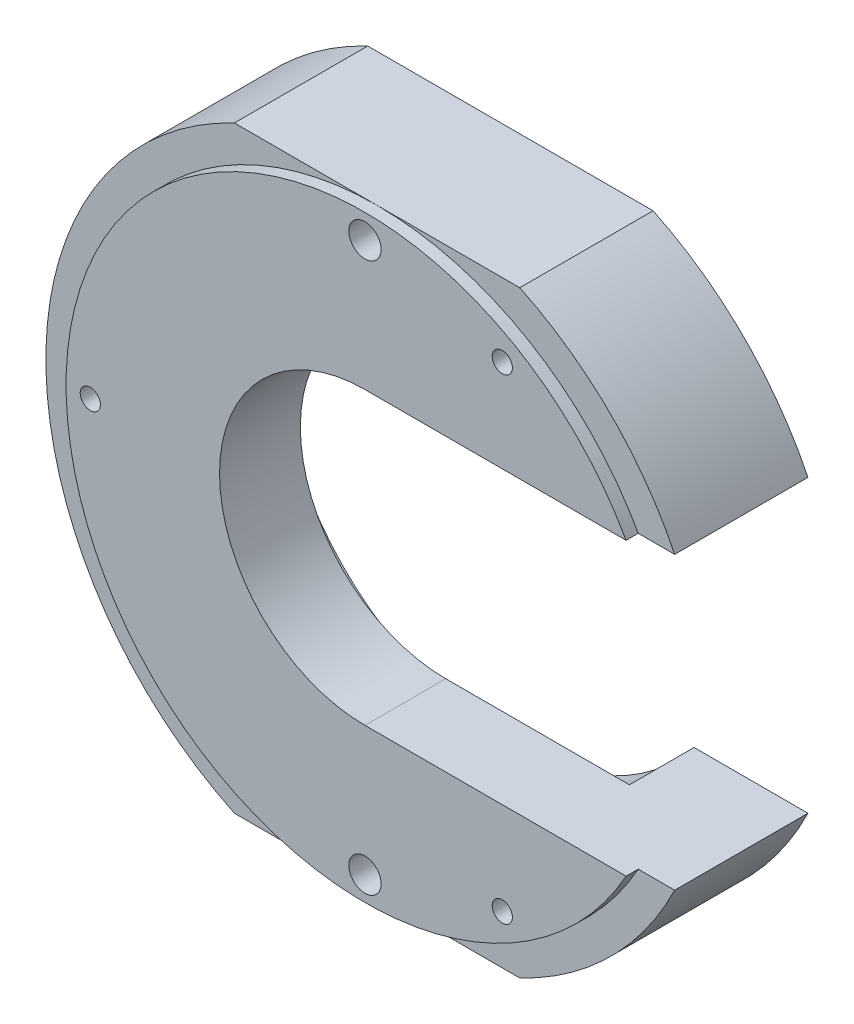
ISO-10303-21;
HEADER;
FILE_DESCRIPTION(('STEP AP214'),'2;1');
FILE_NAME('part.step','',(''),(''),'','','');
FILE_SCHEMA(('AUTOMOTIVE_DESIGN { 1 0 10303 214 1 1 1 1 }'));
ENDSEC;
DATA;
#1=APPLICATION_CONTEXT('core data for automotive mechanical design processes');
#2=APPLICATION_PROTOCOL_DEFINITION('international standard','automotive_design',2000,#1);
#3=PRODUCT_CONTEXT('',#1,'mechanical');
#4=PRODUCT('Part','Part','',(#3));
#5=PRODUCT_RELATED_PRODUCT_CATEGORY('part','',(#4));
#6=PRODUCT_DEFINITION_FORMATION('','',#4);
#7=PRODUCT_DEFINITION_CONTEXT('part definition',#1,'design');
#8=PRODUCT_DEFINITION('design','',#6,#7);
#9=PRODUCT_DEFINITION_SHAPE('','',#8);
#10=(LENGTH_UNIT() NAMED_UNIT(*) SI_UNIT(.MILLI.,.METRE.));
#11=(NAMED_UNIT(*) PLANE_ANGLE_UNIT() SI_UNIT($,.RADIAN.));
#12=(NAMED_UNIT(*) SI_UNIT($,.STERADIAN.) SOLID_ANGLE_UNIT());
#13=UNCERTAINTY_MEASURE_WITH_UNIT(LENGTH_MEASURE(1.E-05),#10,'distance_accuracy_value','');
#14=(GEOMETRIC_REPRESENTATION_CONTEXT(3) GLOBAL_UNCERTAINTY_ASSIGNED_CONTEXT((#13)) GLOBAL_UNIT_ASSIGNED_CONTEXT((#10,
#11,#12)) REPRESENTATION_CONTEXT('',''));
#15=CARTESIAN_POINT('',(0.,0.,0.));
#16=DIRECTION('',(0.,0.,1.));
#17=DIRECTION('',(1.,0.,0.));
#18=AXIS2_PLACEMENT_3D('',#15,#16,#17);
#19=CARTESIAN_POINT('',(0.,0.,18.));
#20=DIRECTION('',(0.,0.,1.));
#21=DIRECTION('',(1.,0.,0.));
#22=AXIS2_PLACEMENT_3D('',#19,#20,#21);
#23=PLANE('',#22);
#24=CARTESIAN_POINT('',(0.,34.,18.));
#25=DIRECTION('',(0.,0.,-1.));
#26=DIRECTION('',(-1.,0.,0.));
#27=AXIS2_PLACEMENT_3D('',#24,#25,#26);
#28=CIRCLE('',#27,2.);
#29=CARTESIAN_POINT('',(-2.,34.,18.));
#30=VERTEX_POINT('',#29);
#31=EDGE_CURVE('E544',#30,#30,#28,.T.);
#32=ORIENTED_EDGE('',*,*,#31,.T.);
#33=EDGE_LOOP('',(#32));
#34=FACE_BOUND('',#33,.T.);
#35=CARTESIAN_POINT('',(0.,-34.,18.));
#36=DIRECTION('',(0.,0.,-1.));
#37=DIRECTION('',(-1.,0.,0.));
#38=AXIS2_PLACEMENT_3D('',#35,#36,#37);
#39=CIRCLE('',#38,2.);
#40=CARTESIAN_POINT('',(-2.,-34.,18.));
#41=VERTEX_POINT('',#40);
#42=EDGE_CURVE('E558',#41,#41,#39,.T.);
#43=ORIENTED_EDGE('',*,*,#42,.T.);
#44=EDGE_LOOP('',(#43));
#45=FACE_BOUND('',#44,.T.);
#46=CARTESIAN_POINT('',(17.,29.4448637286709,18.));
#47=DIRECTION('',(0.,0.,-1.));
#48=DIRECTION('',(-1.,0.,0.));
#49=AXIS2_PLACEMENT_3D('',#46,#47,#48);
#50=CIRCLE('',#49,1.25);
#51=CARTESIAN_POINT('',(15.75,29.4448637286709,18.));
#52=VERTEX_POINT('',#51);
#53=EDGE_CURVE('E564',#52,#52,#50,.T.);
#54=ORIENTED_EDGE('',*,*,#53,.T.);
#55=EDGE_LOOP('',(#54));
#56=FACE_BOUND('',#55,.T.);
#57=CARTESIAN_POINT('',(17.,-29.4448637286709,18.));
#58=DIRECTION('',(0.,0.,-1.));
#59=DIRECTION('',(-1.,0.,0.));
#60=AXIS2_PLACEMENT_3D('',#57,#58,#59);
#61=CIRCLE('',#60,1.25);
#62=CARTESIAN_POINT('',(15.75,-29.4448637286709,18.));
#63=VERTEX_POINT('',#62);
#64=EDGE_CURVE('E573',#63,#63,#61,.T.);
#65=ORIENTED_EDGE('',*,*,#64,.T.);
#66=EDGE_LOOP('',(#65));
#67=FACE_BOUND('',#66,.T.);
#68=CARTESIAN_POINT('',(0.,0.,18.));
#69=DIRECTION('',(0.,0.,1.));
#70=DIRECTION('',(1.,0.,0.));
#71=AXIS2_PLACEMENT_3D('',#68,#69,#70);
#72=CIRCLE('',#71,37.);
#73=CARTESIAN_POINT('',(32.3264597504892,18.,18.));
#74=VERTEX_POINT('',#73);
#75=CARTESIAN_POINT('',(32.3264597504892,-18.,18.));
#76=VERTEX_POINT('',#75);
#77=EDGE_CURVE('E137',#74,#76,#72,.T.);
#78=ORIENTED_EDGE('',*,*,#77,.T.);
#79=DIRECTION('',(-1.,0.,0.));
#80=VECTOR('',#79,1.);
#81=CARTESIAN_POINT('',(0.,-18.,18.));
#82=LINE('',#81,#80);
#83=CARTESIAN_POINT('',(0.,-18.,18.));
#84=VERTEX_POINT('',#83);
#85=EDGE_CURVE('E143',#76,#84,#82,.T.);
#86=ORIENTED_EDGE('',*,*,#85,.T.);
#87=CARTESIAN_POINT('',(0.,0.,18.));
#88=DIRECTION('',(0.,0.,-1.));
#89=DIRECTION('',(1.,0.,0.));
#90=AXIS2_PLACEMENT_3D('',#87,#88,#89);
#91=CIRCLE('',#90,18.);
#92=CARTESIAN_POINT('',(0.,18.,18.));
#93=VERTEX_POINT('',#92);
#94=EDGE_CURVE('E168',#84,#93,#91,.T.);
#95=ORIENTED_EDGE('',*,*,#94,.T.);
#96=DIRECTION('',(1.,0.,0.));
#97=VECTOR('',#96,1.);
#98=CARTESIAN_POINT('',(32.3264597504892,18.,18.));
#99=LINE('',#98,#97);
#100=EDGE_CURVE('E149',#93,#74,#99,.T.);
#101=ORIENTED_EDGE('',*,*,#100,.T.);
#102=EDGE_LOOP('',(#78,#86,#95,#101));
#103=FACE_BOUND('',#102,.T.);
#104=CARTESIAN_POINT('',(-34.,0.,18.));
#105=DIRECTION('',(0.,0.,-1.));
#106=DIRECTION('',(-1.,0.,0.));
#107=AXIS2_PLACEMENT_3D('',#104,#105,#106);
#108=CIRCLE('',#107,1.24999999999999);
#109=CARTESIAN_POINT('',(-35.25,0.,18.));
#110=VERTEX_POINT('',#109);
#111=EDGE_CURVE('E584',#110,#110,#108,.T.);
#112=ORIENTED_EDGE('',*,*,#111,.T.);
#113=EDGE_LOOP('',(#112));
#114=FACE_BOUND('',#113,.T.);
#115=ADVANCED_FACE('F43',(#34,#45,#56,#67,#103,#114),#23,.T.);
#116=CARTESIAN_POINT('',(0.,0.,16.5));
#117=DIRECTION('',(0.,0.,1.));
#118=DIRECTION('',(1.,0.,0.));
#119=AXIS2_PLACEMENT_3D('',#116,#117,#118);
#120=PLANE('',#119);
#121=CARTESIAN_POINT('',(0.,0.,16.5));
#122=DIRECTION('',(0.,0.,1.));
#123=DIRECTION('',(1.,0.,0.));
#124=AXIS2_PLACEMENT_3D('',#121,#122,#123);
#125=CIRCLE('',#124,37.);
#126=CARTESIAN_POINT('',(32.3264597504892,18.,16.5));
#127=VERTEX_POINT('',#126);
#128=CARTESIAN_POINT('',(0.,37.,16.5));
#129=VERTEX_POINT('',#128);
#130=EDGE_CURVE('E53',#127,#129,#125,.T.);
#131=ORIENTED_EDGE('',*,*,#130,.F.);
#132=DIRECTION('',(1.,0.,0.));
#133=VECTOR('',#132,1.);
#134=CARTESIAN_POINT('',(36.8374809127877,18.,16.5));
#135=LINE('',#134,#133);
#136=CARTESIAN_POINT('',(36.8374809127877,18.,16.5));
#137=VERTEX_POINT('',#136);
#138=EDGE_CURVE('E209',#127,#137,#135,.T.);
#139=ORIENTED_EDGE('',*,*,#138,.T.);
#140=CARTESIAN_POINT('',(0.,0.,16.5));
#141=DIRECTION('',(0.,0.,1.));
#142=DIRECTION('',(1.,0.,0.));
#143=AXIS2_PLACEMENT_3D('',#140,#141,#142);
#144=CIRCLE('',#143,41.);
#145=CARTESIAN_POINT('',(17.6635217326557,37.,16.5));
#146=VERTEX_POINT('',#145);
#147=EDGE_CURVE('E195',#137,#146,#144,.T.);
#148=ORIENTED_EDGE('',*,*,#147,.T.);
#149=DIRECTION('',(-1.,0.,0.));
#150=VECTOR('',#149,1.);
#151=CARTESIAN_POINT('',(-17.6635217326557,37.,16.5));
#152=LINE('',#151,#150);
#153=EDGE_CURVE('E200',#146,#129,#152,.T.);
#154=ORIENTED_EDGE('',*,*,#153,.T.);
#155=EDGE_LOOP('',(#131,#139,#148,#154));
#156=FACE_BOUND('',#155,.T.);
#157=ADVANCED_FACE('F272',(#156),#120,.T.);
#158=CARTESIAN_POINT('',(0.,-37.,16.5));
#159=VERTEX_POINT('',#158);
#160=EDGE_CURVE('E11',#129,#159,#125,.T.);
#161=ORIENTED_EDGE('',*,*,#160,.F.);
#162=CARTESIAN_POINT('',(-17.6635217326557,37.,16.5));
#163=VERTEX_POINT('',#162);
#164=EDGE_CURVE('E193',#129,#163,#152,.T.);
#165=ORIENTED_EDGE('',*,*,#164,.T.);
#166=CARTESIAN_POINT('',(0.,0.,16.5));
#167=DIRECTION('',(0.,0.,1.));
#168=DIRECTION('',(1.,0.,0.));
#169=AXIS2_PLACEMENT_3D('',#166,#167,#168);
#170=CIRCLE('',#169,41.);
#171=CARTESIAN_POINT('',(-17.6635217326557,-37.,16.5));
#172=VERTEX_POINT('',#171);
#173=EDGE_CURVE('E197',#163,#172,#170,.T.);
#174=ORIENTED_EDGE('',*,*,#173,.T.);
#175=DIRECTION('',(1.,0.,0.));
#176=VECTOR('',#175,1.);
#177=CARTESIAN_POINT('',(-17.6635217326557,-37.,16.5));
#178=LINE('',#177,#176);
#179=EDGE_CURVE('E201',#172,#159,#178,.T.);
#180=ORIENTED_EDGE('',*,*,#179,.T.);
#181=EDGE_LOOP('',(#161,#165,#174,#180));
#182=FACE_BOUND('',#181,.T.);
#183=ADVANCED_FACE('F266',(#182),#120,.T.);
#184=CARTESIAN_POINT('',(0.,0.,16.5));
#185=DIRECTION('',(0.,0.,-1.));
#186=DIRECTION('',(-1.,0.,0.));
#187=AXIS2_PLACEMENT_3D('',#184,#185,#186);
#188=CYLINDRICAL_SURFACE('',#187,18.);
#189=CARTESIAN_POINT('',(0.,0.,8.));
#190=DIRECTION('',(0.,0.,-1.));
#191=DIRECTION('',(-1.,0.,0.));
#192=AXIS2_PLACEMENT_3D('',#189,#190,#191);
#193=CIRCLE('',#192,18.);
#194=CARTESIAN_POINT('',(0.,-18.,8.));
#195=VERTEX_POINT('',#194);
#196=CARTESIAN_POINT('',(0.,18.,8.));
#197=VERTEX_POINT('',#196);
#198=EDGE_CURVE('E177',#195,#197,#193,.T.);
#199=ORIENTED_EDGE('',*,*,#198,.T.);
#200=DIRECTION('',(0.,0.,-1.));
#201=VECTOR('',#200,1.);
#202=CARTESIAN_POINT('',(0.,18.,16.5));
#203=LINE('',#202,#201);
#204=EDGE_CURVE('E227',#93,#197,#203,.T.);
#205=ORIENTED_EDGE('',*,*,#204,.F.);
#206=ORIENTED_EDGE('',*,*,#94,.F.);
#207=DIRECTION('',(0.,0.,-1.));
#208=VECTOR('',#207,1.);
#209=CARTESIAN_POINT('',(0.,-18.,16.5));
#210=LINE('',#209,#208);
#211=EDGE_CURVE('E164',#84,#195,#210,.T.);
#212=ORIENTED_EDGE('',*,*,#211,.T.);
#213=EDGE_LOOP('',(#199,#205,#206,#212));
#214=FACE_BOUND('',#213,.T.);
#215=ADVANCED_FACE('F276',(#214),#188,.F.);
#216=CARTESIAN_POINT('',(0.,0.,16.5));
#217=DIRECTION('',(0.,0.,-1.));
#218=DIRECTION('',(-1.,0.,0.));
#219=AXIS2_PLACEMENT_3D('',#216,#217,#218);
#220=CYLINDRICAL_SURFACE('',#219,41.);
#221=CARTESIAN_POINT('',(0.,0.,0.));
#222=DIRECTION('',(0.,0.,1.));
#223=DIRECTION('',(1.,0.,0.));
#224=AXIS2_PLACEMENT_3D('',#221,#222,#223);
#225=CIRCLE('',#224,41.);
#226=CARTESIAN_POINT('',(36.8374809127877,18.,0.));
#227=VERTEX_POINT('',#226);
#228=CARTESIAN_POINT('',(17.6635217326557,37.,0.));
#229=VERTEX_POINT('',#228);
#230=EDGE_CURVE('E186',#227,#229,#225,.T.);
#231=ORIENTED_EDGE('',*,*,#230,.T.);
#232=DIRECTION('',(0.,0.,-1.));
#233=VECTOR('',#232,1.);
#234=CARTESIAN_POINT('',(17.6635217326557,37.,16.5));
#235=LINE('',#234,#233);
#236=EDGE_CURVE('E50',#146,#229,#235,.T.);
#237=ORIENTED_EDGE('',*,*,#236,.F.);
#238=ORIENTED_EDGE('',*,*,#147,.F.);
#239=DIRECTION('',(0.,0.,-1.));
#240=VECTOR('',#239,1.);
#241=CARTESIAN_POINT('',(36.8374809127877,18.,16.5));
#242=LINE('',#241,#240);
#243=EDGE_CURVE('E212',#137,#227,#242,.T.);
#244=ORIENTED_EDGE('',*,*,#243,.T.);
#245=EDGE_LOOP('',(#231,#237,#238,#244));
#246=FACE_BOUND('',#245,.T.);
#247=ADVANCED_FACE('F44',(#246),#220,.T.);
#248=CARTESIAN_POINT('',(-17.6635217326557,37.,16.5));
#249=DIRECTION('',(0.,-1.,0.));
#250=DIRECTION('',(0.,0.,-1.));
#251=AXIS2_PLACEMENT_3D('',#248,#249,#250);
#252=PLANE('',#251);
#253=DIRECTION('',(-1.,0.,0.));
#254=VECTOR('',#253,1.);
#255=CARTESIAN_POINT('',(-17.6635217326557,37.,0.));
#256=LINE('',#255,#254);
#257=CARTESIAN_POINT('',(-17.6635217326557,37.,0.));
#258=VERTEX_POINT('',#257);
#259=EDGE_CURVE('E211',#229,#258,#256,.T.);
#260=ORIENTED_EDGE('',*,*,#259,.T.);
#261=DIRECTION('',(0.,0.,-1.));
#262=VECTOR('',#261,1.);
#263=CARTESIAN_POINT('',(-17.6635217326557,37.,16.5));
#264=LINE('',#263,#262);
#265=EDGE_CURVE('E237',#163,#258,#264,.T.);
#266=ORIENTED_EDGE('',*,*,#265,.F.);
#267=ORIENTED_EDGE('',*,*,#164,.F.);
#268=ORIENTED_EDGE('',*,*,#153,.F.);
#269=ORIENTED_EDGE('',*,*,#236,.T.);
#270=EDGE_LOOP('',(#260,#266,#267,#268,#269));
#271=FACE_BOUND('',#270,.T.);
#272=ADVANCED_FACE('F247',(#271),#252,.F.);
#273=CARTESIAN_POINT('',(0.,0.,16.5));
#274=DIRECTION('',(0.,0.,-1.));
#275=DIRECTION('',(-1.,0.,0.));
#276=AXIS2_PLACEMENT_3D('',#273,#274,#275);
#277=CYLINDRICAL_SURFACE('',#276,41.);
#278=CARTESIAN_POINT('',(0.,0.,0.));
#279=DIRECTION('',(0.,0.,1.));
#280=DIRECTION('',(1.,0.,0.));
#281=AXIS2_PLACEMENT_3D('',#278,#279,#280);
#282=CIRCLE('',#281,41.);
#283=CARTESIAN_POINT('',(-17.6635217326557,-37.,0.));
#284=VERTEX_POINT('',#283);
#285=EDGE_CURVE('E216',#258,#284,#282,.T.);
#286=ORIENTED_EDGE('',*,*,#285,.T.);
#287=DIRECTION('',(0.,0.,-1.));
#288=VECTOR('',#287,1.);
#289=CARTESIAN_POINT('',(-17.6635217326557,-37.,16.5));
#290=LINE('',#289,#288);
#291=EDGE_CURVE('E240',#172,#284,#290,.T.);
#292=ORIENTED_EDGE('',*,*,#291,.F.);
#293=ORIENTED_EDGE('',*,*,#173,.F.);
#294=ORIENTED_EDGE('',*,*,#265,.T.);
#295=EDGE_LOOP('',(#286,#292,#293,#294));
#296=FACE_BOUND('',#295,.T.);
#297=ADVANCED_FACE('F261',(#296),#277,.T.);
#298=CARTESIAN_POINT('',(-17.6635217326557,-37.,16.5));
#299=DIRECTION('',(0.,1.,0.));
#300=DIRECTION('',(0.,0.,1.));
#301=AXIS2_PLACEMENT_3D('',#298,#299,#300);
#302=PLANE('',#301);
#303=DIRECTION('',(1.,0.,0.));
#304=VECTOR('',#303,1.);
#305=CARTESIAN_POINT('',(-17.6635217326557,-37.,0.));
#306=LINE('',#305,#304);
#307=CARTESIAN_POINT('',(17.6635217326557,-37.,0.));
#308=VERTEX_POINT('',#307);
#309=EDGE_CURVE('E218',#284,#308,#306,.T.);
#310=ORIENTED_EDGE('',*,*,#309,.T.);
#311=DIRECTION('',(0.,0.,-1.));
#312=VECTOR('',#311,1.);
#313=CARTESIAN_POINT('',(17.6635217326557,-37.,16.5));
#314=LINE('',#313,#312);
#315=CARTESIAN_POINT('',(17.6635217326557,-37.,16.5));
#316=VERTEX_POINT('',#315);
#317=EDGE_CURVE('E234',#316,#308,#314,.T.);
#318=ORIENTED_EDGE('',*,*,#317,.F.);
#319=EDGE_CURVE('E204',#159,#316,#178,.T.);
#320=ORIENTED_EDGE('',*,*,#319,.F.);
#321=ORIENTED_EDGE('',*,*,#179,.F.);
#322=ORIENTED_EDGE('',*,*,#291,.T.);
#323=EDGE_LOOP('',(#310,#318,#320,#321,#322));
#324=FACE_BOUND('',#323,.T.);
#325=ADVANCED_FACE('F262',(#324),#302,.F.);
#326=CARTESIAN_POINT('',(0.,0.,16.5));
#327=DIRECTION('',(0.,0.,-1.));
#328=DIRECTION('',(-1.,0.,0.));
#329=AXIS2_PLACEMENT_3D('',#326,#327,#328);
#330=CYLINDRICAL_SURFACE('',#329,41.);
#331=CARTESIAN_POINT('',(0.,0.,0.));
#332=DIRECTION('',(0.,0.,1.));
#333=DIRECTION('',(1.,0.,0.));
#334=AXIS2_PLACEMENT_3D('',#331,#332,#333);
#335=CIRCLE('',#334,41.);
#336=CARTESIAN_POINT('',(36.8374809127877,-18.,0.));
#337=VERTEX_POINT('',#336);
#338=EDGE_CURVE('E219',#308,#337,#335,.T.);
#339=ORIENTED_EDGE('',*,*,#338,.T.);
#340=DIRECTION('',(0.,0.,-1.));
#341=VECTOR('',#340,1.);
#342=CARTESIAN_POINT('',(36.8374809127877,-18.,16.5));
#343=LINE('',#342,#341);
#344=CARTESIAN_POINT('',(36.8374809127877,-18.,16.5));
#345=VERTEX_POINT('',#344);
#346=EDGE_CURVE('E233',#345,#337,#343,.T.);
#347=ORIENTED_EDGE('',*,*,#346,.F.);
#348=CARTESIAN_POINT('',(0.,0.,16.5));
#349=DIRECTION('',(0.,0.,1.));
#350=DIRECTION('',(1.,0.,0.));
#351=AXIS2_PLACEMENT_3D('',#348,#349,#350);
#352=CIRCLE('',#351,41.);
#353=EDGE_CURVE('E202',#316,#345,#352,.T.);
#354=ORIENTED_EDGE('',*,*,#353,.F.);
#355=ORIENTED_EDGE('',*,*,#317,.T.);
#356=EDGE_LOOP('',(#339,#347,#354,#355));
#357=FACE_BOUND('',#356,.T.);
#358=ADVANCED_FACE('F300',(#357),#330,.T.);
#359=CARTESIAN_POINT('',(36.8374809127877,-18.,16.5));
#360=DIRECTION('',(0.,-1.,0.));
#361=DIRECTION('',(1.,0.,0.));
#362=AXIS2_PLACEMENT_3D('',#359,#360,#361);
#363=PLANE('',#362);
#364=DIRECTION('',(-1.,0.,0.));
#365=VECTOR('',#364,1.);
#366=CARTESIAN_POINT('',(36.8374809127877,-18.,0.));
#367=LINE('',#366,#365);
#368=CARTESIAN_POINT('',(22.7376340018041,-18.,0.));
#369=VERTEX_POINT('',#368);
#370=EDGE_CURVE('E221',#337,#369,#367,.T.);
#371=ORIENTED_EDGE('',*,*,#370,.T.);
#372=DIRECTION('',(0.,0.,-1.));
#373=VECTOR('',#372,1.);
#374=CARTESIAN_POINT('',(22.7376340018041,-18.,8.));
#375=LINE('',#374,#373);
#376=CARTESIAN_POINT('',(22.7376340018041,-18.,8.));
#377=VERTEX_POINT('',#376);
#378=EDGE_CURVE('E190',#377,#369,#375,.T.);
#379=ORIENTED_EDGE('',*,*,#378,.F.);
#380=DIRECTION('',(1.,0.,0.));
#381=VECTOR('',#380,1.);
#382=CARTESIAN_POINT('',(0.,-18.,8.));
#383=LINE('',#382,#381);
#384=EDGE_CURVE('E185',#195,#377,#383,.T.);
#385=ORIENTED_EDGE('',*,*,#384,.F.);
#386=ORIENTED_EDGE('',*,*,#211,.F.);
#387=ORIENTED_EDGE('',*,*,#85,.F.);
#388=DIRECTION('',(0.,0.,-1.));
#389=VECTOR('',#388,1.);
#390=CARTESIAN_POINT('',(32.3264597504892,-18.,18.));
#391=LINE('',#390,#389);
#392=CARTESIAN_POINT('',(32.3264597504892,-18.,16.5));
#393=VERTEX_POINT('',#392);
#394=EDGE_CURVE('E152',#76,#393,#391,.T.);
#395=ORIENTED_EDGE('',*,*,#394,.T.);
#396=DIRECTION('',(-1.,0.,0.));
#397=VECTOR('',#396,1.);
#398=CARTESIAN_POINT('',(36.8374809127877,-18.,16.5));
#399=LINE('',#398,#397);
#400=EDGE_CURVE('E210',#345,#393,#399,.T.);
#401=ORIENTED_EDGE('',*,*,#400,.F.);
#402=ORIENTED_EDGE('',*,*,#346,.T.);
#403=EDGE_LOOP('',(#371,#379,#385,#386,#387,#395,#401,#402));
#404=FACE_BOUND('',#403,.T.);
#405=ADVANCED_FACE('F162',(#404),#363,.F.);
#406=CARTESIAN_POINT('',(36.8374809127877,18.,16.5));
#407=DIRECTION('',(0.,1.,0.));
#408=DIRECTION('',(0.,0.,1.));
#409=AXIS2_PLACEMENT_3D('',#406,#407,#408);
#410=PLANE('',#409);
#411=DIRECTION('',(-1.,0.,0.));
#412=VECTOR('',#411,1.);
#413=CARTESIAN_POINT('',(22.7376340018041,18.,8.));
#414=LINE('',#413,#412);
#415=CARTESIAN_POINT('',(22.7376340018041,18.,8.));
#416=VERTEX_POINT('',#415);
#417=EDGE_CURVE('E180',#416,#197,#414,.T.);
#418=ORIENTED_EDGE('',*,*,#417,.F.);
#419=DIRECTION('',(0.,0.,-1.));
#420=VECTOR('',#419,1.);
#421=CARTESIAN_POINT('',(22.7376340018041,18.,8.));
#422=LINE('',#421,#420);
#423=CARTESIAN_POINT('',(22.7376340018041,18.,0.));
#424=VERTEX_POINT('',#423);
#425=EDGE_CURVE('E184',#416,#424,#422,.T.);
#426=ORIENTED_EDGE('',*,*,#425,.T.);
#427=DIRECTION('',(1.,0.,0.));
#428=VECTOR('',#427,1.);
#429=CARTESIAN_POINT('',(36.8374809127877,18.,0.));
#430=LINE('',#429,#428);
#431=EDGE_CURVE('E196',#424,#227,#430,.T.);
#432=ORIENTED_EDGE('',*,*,#431,.T.);
#433=ORIENTED_EDGE('',*,*,#243,.F.);
#434=ORIENTED_EDGE('',*,*,#138,.F.);
#435=DIRECTION('',(0.,0.,-1.));
#436=VECTOR('',#435,1.);
#437=CARTESIAN_POINT('',(32.3264597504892,18.,18.));
#438=LINE('',#437,#436);
#439=EDGE_CURVE('E158',#74,#127,#438,.T.);
#440=ORIENTED_EDGE('',*,*,#439,.F.);
#441=ORIENTED_EDGE('',*,*,#100,.F.);
#442=ORIENTED_EDGE('',*,*,#204,.T.);
#443=EDGE_LOOP('',(#418,#426,#432,#433,#434,#440,#441,#442));
#444=FACE_BOUND('',#443,.T.);
#445=ADVANCED_FACE('F267',(#444),#410,.F.);
#446=EDGE_CURVE('E55',#159,#393,#125,.T.);
#447=ORIENTED_EDGE('',*,*,#446,.F.);
#448=ORIENTED_EDGE('',*,*,#319,.T.);
#449=ORIENTED_EDGE('',*,*,#353,.T.);
#450=ORIENTED_EDGE('',*,*,#400,.T.);
#451=EDGE_LOOP('',(#447,#448,#449,#450));
#452=FACE_BOUND('',#451,.T.);
#453=ADVANCED_FACE('F274',(#452),#120,.T.);
#454=CARTESIAN_POINT('',(0.,0.,0.));
#455=DIRECTION('',(0.,0.,1.));
#456=DIRECTION('',(1.,0.,0.));
#457=AXIS2_PLACEMENT_3D('',#454,#455,#456);
#458=PLANE('',#457);
#459=CARTESIAN_POINT('',(17.,29.4448637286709,0.));
#460=DIRECTION('',(0.,0.,-1.));
#461=DIRECTION('',(-1.,0.,0.));
#462=AXIS2_PLACEMENT_3D('',#459,#460,#461);
#463=CIRCLE('',#462,1.525);
#464=CARTESIAN_POINT('',(15.475,29.4448637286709,0.));
#465=VERTEX_POINT('',#464);
#466=EDGE_CURVE('E559',#465,#465,#463,.T.);
#467=ORIENTED_EDGE('',*,*,#466,.F.);
#468=EDGE_LOOP('',(#467));
#469=FACE_BOUND('',#468,.T.);
#470=CARTESIAN_POINT('',(17.,-29.4448637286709,0.));
#471=DIRECTION('',(0.,0.,-1.));
#472=DIRECTION('',(-1.,0.,0.));
#473=AXIS2_PLACEMENT_3D('',#470,#471,#472);
#474=CIRCLE('',#473,1.525);
#475=CARTESIAN_POINT('',(15.475,-29.4448637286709,0.));
#476=VERTEX_POINT('',#475);
#477=EDGE_CURVE('E568',#476,#476,#474,.T.);
#478=ORIENTED_EDGE('',*,*,#477,.F.);
#479=EDGE_LOOP('',(#478));
#480=FACE_BOUND('',#479,.T.);
#481=CARTESIAN_POINT('',(-34.,0.,0.));
#482=DIRECTION('',(0.,0.,-1.));
#483=DIRECTION('',(-1.,0.,0.));
#484=AXIS2_PLACEMENT_3D('',#481,#482,#483);
#485=CIRCLE('',#484,1.525);
#486=CARTESIAN_POINT('',(-35.525,0.,0.));
#487=VERTEX_POINT('',#486);
#488=EDGE_CURVE('E580',#487,#487,#485,.T.);
#489=ORIENTED_EDGE('',*,*,#488,.F.);
#490=EDGE_LOOP('',(#489));
#491=FACE_BOUND('',#490,.T.);
#492=CARTESIAN_POINT('',(0.,34.,0.));
#493=DIRECTION('',(0.,0.,-1.));
#494=DIRECTION('',(-1.,0.,0.));
#495=AXIS2_PLACEMENT_3D('',#492,#493,#494);
#496=CIRCLE('',#495,2.95);
#497=CARTESIAN_POINT('',(-2.95,34.,0.));
#498=VERTEX_POINT('',#497);
#499=EDGE_CURVE('E587',#498,#498,#496,.T.);
#500=ORIENTED_EDGE('',*,*,#499,.F.);
#501=EDGE_LOOP('',(#500));
#502=FACE_BOUND('',#501,.T.);
#503=CARTESIAN_POINT('',(0.,-34.,0.));
#504=DIRECTION('',(0.,0.,-1.));
#505=DIRECTION('',(-1.,0.,0.));
#506=AXIS2_PLACEMENT_3D('',#503,#504,#505);
#507=CIRCLE('',#506,2.95);
#508=CARTESIAN_POINT('',(-2.95,-34.,0.));
#509=VERTEX_POINT('',#508);
#510=EDGE_CURVE('E591',#509,#509,#507,.T.);
#511=ORIENTED_EDGE('',*,*,#510,.F.);
#512=EDGE_LOOP('',(#511));
#513=FACE_BOUND('',#512,.T.);
#514=ORIENTED_EDGE('',*,*,#431,.F.);
#515=CARTESIAN_POINT('',(0.,0.,0.));
#516=DIRECTION('',(0.,0.,-1.));
#517=DIRECTION('',(-1.,0.,0.));
#518=AXIS2_PLACEMENT_3D('',#515,#516,#517);
#519=CIRCLE('',#518,29.);
#520=EDGE_CURVE('E160',#369,#424,#519,.T.);
#521=ORIENTED_EDGE('',*,*,#520,.F.);
#522=ORIENTED_EDGE('',*,*,#370,.F.);
#523=ORIENTED_EDGE('',*,*,#338,.F.);
#524=ORIENTED_EDGE('',*,*,#309,.F.);
#525=ORIENTED_EDGE('',*,*,#285,.F.);
#526=ORIENTED_EDGE('',*,*,#259,.F.);
#527=ORIENTED_EDGE('',*,*,#230,.F.);
#528=EDGE_LOOP('',(#514,#521,#522,#523,#524,#525,#526,#527));
#529=FACE_BOUND('',#528,.T.);
#530=ADVANCED_FACE('F257',(#469,#480,#491,#502,#513,#529),#458,.F.);
#531=CARTESIAN_POINT('',(0.,0.,8.));
#532=DIRECTION('',(0.,0.,-1.));
#533=DIRECTION('',(-1.,0.,0.));
#534=AXIS2_PLACEMENT_3D('',#531,#532,#533);
#535=CYLINDRICAL_SURFACE('',#534,29.);
#536=ORIENTED_EDGE('',*,*,#520,.T.);
#537=ORIENTED_EDGE('',*,*,#425,.F.);
#538=CARTESIAN_POINT('',(0.,0.,8.));
#539=DIRECTION('',(0.,0.,-1.));
#540=DIRECTION('',(-1.,0.,0.));
#541=AXIS2_PLACEMENT_3D('',#538,#539,#540);
#542=CIRCLE('',#541,29.);
#543=EDGE_CURVE('E172',#377,#416,#542,.T.);
#544=ORIENTED_EDGE('',*,*,#543,.F.);
#545=ORIENTED_EDGE('',*,*,#378,.T.);
#546=EDGE_LOOP('',(#536,#537,#544,#545));
#547=FACE_BOUND('',#546,.T.);
#548=ADVANCED_FACE('F293',(#547),#535,.F.);
#549=CARTESIAN_POINT('',(0.,0.,8.));
#550=DIRECTION('',(0.,0.,-1.));
#551=DIRECTION('',(-1.,0.,0.));
#552=AXIS2_PLACEMENT_3D('',#549,#550,#551);
#553=PLANE('',#552);
#554=ORIENTED_EDGE('',*,*,#543,.T.);
#555=ORIENTED_EDGE('',*,*,#417,.T.);
#556=ORIENTED_EDGE('',*,*,#198,.F.);
#557=ORIENTED_EDGE('',*,*,#384,.T.);
#558=EDGE_LOOP('',(#554,#555,#556,#557));
#559=FACE_BOUND('',#558,.T.);
#560=ADVANCED_FACE('F335',(#559),#553,.T.);
#561=CARTESIAN_POINT('',(0.,0.,18.));
#562=DIRECTION('',(0.,0.,-1.));
#563=DIRECTION('',(-1.,0.,0.));
#564=AXIS2_PLACEMENT_3D('',#561,#562,#563);
#565=CYLINDRICAL_SURFACE('',#564,37.);
#566=ORIENTED_EDGE('',*,*,#130,.T.);
#567=ORIENTED_EDGE('',*,*,#160,.T.);
#568=ORIENTED_EDGE('',*,*,#446,.T.);
#569=ORIENTED_EDGE('',*,*,#394,.F.);
#570=ORIENTED_EDGE('',*,*,#77,.F.);
#571=ORIENTED_EDGE('',*,*,#439,.T.);
#572=EDGE_LOOP('',(#566,#567,#568,#569,#570,#571));
#573=FACE_BOUND('',#572,.T.);
#574=ADVANCED_FACE('F154',(#573),#565,.T.);
#575=CARTESIAN_POINT('',(0.,-34.,4.));
#576=DIRECTION('',(0.,0.,-1.));
#577=DIRECTION('',(-1.,0.,0.));
#578=AXIS2_PLACEMENT_3D('',#575,#576,#577);
#579=CYLINDRICAL_SURFACE('',#578,2.95);
#580=CARTESIAN_POINT('',(0.,-34.,4.));
#581=DIRECTION('',(0.,0.,-1.));
#582=DIRECTION('',(-1.,0.,0.));
#583=AXIS2_PLACEMENT_3D('',#580,#581,#582);
#584=CIRCLE('',#583,2.95);
#585=CARTESIAN_POINT('',(-2.95,-34.,4.));
#586=VERTEX_POINT('',#585);
#587=EDGE_CURVE('E586',#586,#586,#584,.T.);
#588=ORIENTED_EDGE('',*,*,#587,.F.);
#589=EDGE_LOOP('',(#588));
#590=FACE_BOUND('',#589,.T.);
#591=ORIENTED_EDGE('',*,*,#510,.T.);
#592=EDGE_LOOP('',(#591));
#593=FACE_BOUND('',#592,.T.);
#594=ADVANCED_FACE('F382',(#590,#593),#579,.F.);
#595=CARTESIAN_POINT('',(0.,-34.,4.));
#596=DIRECTION('',(0.,0.,-1.));
#597=DIRECTION('',(-1.,0.,0.));
#598=AXIS2_PLACEMENT_3D('',#595,#596,#597);
#599=PLANE('',#598);
#600=CARTESIAN_POINT('',(0.,-34.,4.));
#601=DIRECTION('',(0.,0.,-1.));
#602=DIRECTION('',(-1.,0.,0.));
#603=AXIS2_PLACEMENT_3D('',#600,#601,#602);
#604=CIRCLE('',#603,2.025);
#605=CARTESIAN_POINT('',(-2.025,-34.,4.));
#606=VERTEX_POINT('',#605);
#607=EDGE_CURVE('E547',#606,#606,#604,.T.);
#608=ORIENTED_EDGE('',*,*,#607,.F.);
#609=EDGE_LOOP('',(#608));
#610=FACE_BOUND('',#609,.T.);
#611=ORIENTED_EDGE('',*,*,#587,.T.);
#612=EDGE_LOOP('',(#611));
#613=FACE_BOUND('',#612,.T.);
#614=ADVANCED_FACE('F399',(#610,#613),#599,.T.);
#615=CARTESIAN_POINT('',(0.,34.,4.));
#616=DIRECTION('',(0.,0.,-1.));
#617=DIRECTION('',(-1.,0.,0.));
#618=AXIS2_PLACEMENT_3D('',#615,#616,#617);
#619=CYLINDRICAL_SURFACE('',#618,2.95);
#620=CARTESIAN_POINT('',(0.,34.,4.));
#621=DIRECTION('',(0.,0.,-1.));
#622=DIRECTION('',(-1.,0.,0.));
#623=AXIS2_PLACEMENT_3D('',#620,#621,#622);
#624=CIRCLE('',#623,2.95);
#625=CARTESIAN_POINT('',(-2.95,34.,4.));
#626=VERTEX_POINT('',#625);
#627=EDGE_CURVE('E175',#626,#626,#624,.T.);
#628=ORIENTED_EDGE('',*,*,#627,.F.);
#629=EDGE_LOOP('',(#628));
#630=FACE_BOUND('',#629,.T.);
#631=ORIENTED_EDGE('',*,*,#499,.T.);
#632=EDGE_LOOP('',(#631));
#633=FACE_BOUND('',#632,.T.);
#634=ADVANCED_FACE('F410',(#630,#633),#619,.F.);
#635=CARTESIAN_POINT('',(0.,34.,4.));
#636=DIRECTION('',(0.,0.,-1.));
#637=DIRECTION('',(-1.,0.,0.));
#638=AXIS2_PLACEMENT_3D('',#635,#636,#637);
#639=PLANE('',#638);
#640=CARTESIAN_POINT('',(0.,34.,4.));
#641=DIRECTION('',(0.,0.,-1.));
#642=DIRECTION('',(-1.,0.,0.));
#643=AXIS2_PLACEMENT_3D('',#640,#641,#642);
#644=CIRCLE('',#643,2.025);
#645=CARTESIAN_POINT('',(-2.025,34.,4.));
#646=VERTEX_POINT('',#645);
#647=EDGE_CURVE('E543',#646,#646,#644,.T.);
#648=ORIENTED_EDGE('',*,*,#647,.F.);
#649=EDGE_LOOP('',(#648));
#650=FACE_BOUND('',#649,.T.);
#651=ORIENTED_EDGE('',*,*,#627,.T.);
#652=EDGE_LOOP('',(#651));
#653=FACE_BOUND('',#652,.T.);
#654=ADVANCED_FACE('F416',(#650,#653),#639,.T.);
#655=CARTESIAN_POINT('',(-34.,0.,0.));
#656=DIRECTION('',(0.,0.,-1.));
#657=DIRECTION('',(-1.,0.,0.));
#658=AXIS2_PLACEMENT_3D('',#655,#656,#657);
#659=CYLINDRICAL_SURFACE('',#658,1.25);
#660=ORIENTED_EDGE('',*,*,#111,.F.);
#661=EDGE_LOOP('',(#660));
#662=FACE_BOUND('',#661,.T.);
#663=CARTESIAN_POINT('',(-34.,0.,0.275));
#664=DIRECTION('',(0.,0.,-1.));
#665=DIRECTION('',(-1.,0.,0.));
#666=AXIS2_PLACEMENT_3D('',#663,#664,#665);
#667=CIRCLE('',#666,1.25);
#668=CARTESIAN_POINT('',(-35.25,0.,0.275));
#669=VERTEX_POINT('',#668);
#670=EDGE_CURVE('E578',#669,#669,#667,.T.);
#671=ORIENTED_EDGE('',*,*,#670,.T.);
#672=EDGE_LOOP('',(#671));
#673=FACE_BOUND('',#672,.T.);
#674=ADVANCED_FACE('F428',(#662,#673),#659,.F.);
#675=CARTESIAN_POINT('',(-34.,0.,0.));
#676=DIRECTION('',(0.,0.,-1.));
#677=DIRECTION('',(-1.,0.,0.));
#678=AXIS2_PLACEMENT_3D('',#675,#676,#677);
#679=CONICAL_SURFACE('',#678,1.525,0.78539816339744);
#680=ORIENTED_EDGE('',*,*,#670,.F.);
#681=EDGE_LOOP('',(#680));
#682=FACE_BOUND('',#681,.T.);
#683=ORIENTED_EDGE('',*,*,#488,.T.);
#684=EDGE_LOOP('',(#683));
#685=FACE_BOUND('',#684,.T.);
#686=ADVANCED_FACE('F442',(#682,#685),#679,.F.);
#687=CARTESIAN_POINT('',(17.,-29.4448637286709,0.));
#688=DIRECTION('',(0.,0.,-1.));
#689=DIRECTION('',(-1.,0.,0.));
#690=AXIS2_PLACEMENT_3D('',#687,#688,#689);
#691=CYLINDRICAL_SURFACE('',#690,1.25);
#692=ORIENTED_EDGE('',*,*,#64,.F.);
#693=EDGE_LOOP('',(#692));
#694=FACE_BOUND('',#693,.T.);
#695=CARTESIAN_POINT('',(17.,-29.4448637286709,0.275));
#696=DIRECTION('',(0.,0.,-1.));
#697=DIRECTION('',(-1.,0.,0.));
#698=AXIS2_PLACEMENT_3D('',#695,#696,#697);
#699=CIRCLE('',#698,1.25);
#700=CARTESIAN_POINT('',(15.75,-29.4448637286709,0.275));
#701=VERTEX_POINT('',#700);
#702=EDGE_CURVE('E571',#701,#701,#699,.T.);
#703=ORIENTED_EDGE('',*,*,#702,.T.);
#704=EDGE_LOOP('',(#703));
#705=FACE_BOUND('',#704,.T.);
#706=ADVANCED_FACE('F454',(#694,#705),#691,.F.);
#707=CARTESIAN_POINT('',(17.,-29.4448637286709,0.));
#708=DIRECTION('',(0.,0.,-1.));
#709=DIRECTION('',(-1.,0.,0.));
#710=AXIS2_PLACEMENT_3D('',#707,#708,#709);
#711=CONICAL_SURFACE('',#710,1.525,0.785398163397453);
#712=ORIENTED_EDGE('',*,*,#702,.F.);
#713=EDGE_LOOP('',(#712));
#714=FACE_BOUND('',#713,.T.);
#715=ORIENTED_EDGE('',*,*,#477,.T.);
#716=EDGE_LOOP('',(#715));
#717=FACE_BOUND('',#716,.T.);
#718=ADVANCED_FACE('F463',(#714,#717),#711,.F.);
#719=CARTESIAN_POINT('',(17.,29.4448637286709,0.));
#720=DIRECTION('',(0.,0.,-1.));
#721=DIRECTION('',(-1.,0.,0.));
#722=AXIS2_PLACEMENT_3D('',#719,#720,#721);
#723=CYLINDRICAL_SURFACE('',#722,1.25);
#724=ORIENTED_EDGE('',*,*,#53,.F.);
#725=EDGE_LOOP('',(#724));
#726=FACE_BOUND('',#725,.T.);
#727=CARTESIAN_POINT('',(17.,29.4448637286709,0.275));
#728=DIRECTION('',(0.,0.,-1.));
#729=DIRECTION('',(-1.,0.,0.));
#730=AXIS2_PLACEMENT_3D('',#727,#728,#729);
#731=CIRCLE('',#730,1.25);
#732=CARTESIAN_POINT('',(15.75,29.4448637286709,0.275));
#733=VERTEX_POINT('',#732);
#734=EDGE_CURVE('E565',#733,#733,#731,.T.);
#735=ORIENTED_EDGE('',*,*,#734,.T.);
#736=EDGE_LOOP('',(#735));
#737=FACE_BOUND('',#736,.T.);
#738=ADVANCED_FACE('F471',(#726,#737),#723,.F.);
#739=CARTESIAN_POINT('',(17.,29.4448637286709,0.));
#740=DIRECTION('',(0.,0.,-1.));
#741=DIRECTION('',(-1.,0.,0.));
#742=AXIS2_PLACEMENT_3D('',#739,#740,#741);
#743=CONICAL_SURFACE('',#742,1.525,0.785398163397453);
#744=ORIENTED_EDGE('',*,*,#734,.F.);
#745=EDGE_LOOP('',(#744));
#746=FACE_BOUND('',#745,.T.);
#747=ORIENTED_EDGE('',*,*,#466,.T.);
#748=EDGE_LOOP('',(#747));
#749=FACE_BOUND('',#748,.T.);
#750=ADVANCED_FACE('F482',(#746,#749),#743,.F.);
#751=CARTESIAN_POINT('',(0.,-34.,4.));
#752=DIRECTION('',(0.,0.,-1.));
#753=DIRECTION('',(-1.,0.,0.));
#754=AXIS2_PLACEMENT_3D('',#751,#752,#753);
#755=CYLINDRICAL_SURFACE('',#754,2.);
#756=ORIENTED_EDGE('',*,*,#42,.F.);
#757=EDGE_LOOP('',(#756));
#758=FACE_BOUND('',#757,.T.);
#759=CARTESIAN_POINT('',(0.,-34.,4.025));
#760=DIRECTION('',(0.,0.,-1.));
#761=DIRECTION('',(-1.,0.,0.));
#762=AXIS2_PLACEMENT_3D('',#759,#760,#761);
#763=CIRCLE('',#762,2.);
#764=CARTESIAN_POINT('',(-2.,-34.,4.025));
#765=VERTEX_POINT('',#764);
#766=EDGE_CURVE('E551',#765,#765,#763,.T.);
#767=ORIENTED_EDGE('',*,*,#766,.T.);
#768=EDGE_LOOP('',(#767));
#769=FACE_BOUND('',#768,.T.);
#770=ADVANCED_FACE('F492',(#758,#769),#755,.F.);
#771=CARTESIAN_POINT('',(0.,-34.,4.));
#772=DIRECTION('',(0.,0.,-1.));
#773=DIRECTION('',(-1.,0.,0.));
#774=AXIS2_PLACEMENT_3D('',#771,#772,#773);
#775=CONICAL_SURFACE('',#774,2.025,0.785398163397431);
#776=ORIENTED_EDGE('',*,*,#766,.F.);
#777=EDGE_LOOP('',(#776));
#778=FACE_BOUND('',#777,.T.);
#779=ORIENTED_EDGE('',*,*,#607,.T.);
#780=EDGE_LOOP('',(#779));
#781=FACE_BOUND('',#780,.T.);
#782=ADVANCED_FACE('F502',(#778,#781),#775,.F.);
#783=CARTESIAN_POINT('',(0.,34.,4.));
#784=DIRECTION('',(0.,0.,-1.));
#785=DIRECTION('',(-1.,0.,0.));
#786=AXIS2_PLACEMENT_3D('',#783,#784,#785);
#787=CYLINDRICAL_SURFACE('',#786,2.);
#788=ORIENTED_EDGE('',*,*,#31,.F.);
#789=EDGE_LOOP('',(#788));
#790=FACE_BOUND('',#789,.T.);
#791=CARTESIAN_POINT('',(0.,34.,4.025));
#792=DIRECTION('',(0.,0.,-1.));
#793=DIRECTION('',(-1.,0.,0.));
#794=AXIS2_PLACEMENT_3D('',#791,#792,#793);
#795=CIRCLE('',#794,2.);
#796=CARTESIAN_POINT('',(-2.,34.,4.025));
#797=VERTEX_POINT('',#796);
#798=EDGE_CURVE('E538',#797,#797,#795,.T.);
#799=ORIENTED_EDGE('',*,*,#798,.T.);
#800=EDGE_LOOP('',(#799));
#801=FACE_BOUND('',#800,.T.);
#802=ADVANCED_FACE('F511',(#790,#801),#787,.F.);
#803=CARTESIAN_POINT('',(0.,34.,4.));
#804=DIRECTION('',(0.,0.,-1.));
#805=DIRECTION('',(-1.,0.,0.));
#806=AXIS2_PLACEMENT_3D('',#803,#804,#805);
#807=CONICAL_SURFACE('',#806,2.025,0.785398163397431);
#808=ORIENTED_EDGE('',*,*,#798,.F.);
#809=EDGE_LOOP('',(#808));
#810=FACE_BOUND('',#809,.T.);
#811=ORIENTED_EDGE('',*,*,#647,.T.);
#812=EDGE_LOOP('',(#811));
#813=FACE_BOUND('',#812,.T.);
#814=ADVANCED_FACE('F522',(#810,#813),#807,.F.);
#815=CLOSED_SHELL('',(#115,#157,#183,#215,#247,#272,#297,#325,#358,#405,#445,#453,#530,#548,
#560,#574,#594,#614,#634,#654,#674,#686,#706,#718,#738,#750,#770,#782,#802,#814));
#816=MANIFOLD_SOLID_BREP('B2',#815);
#817=ADVANCED_BREP_SHAPE_REPRESENTATION('',(#18,#816),#14);
#818=SHAPE_DEFINITION_REPRESENTATION(#9,#817);
ENDSEC;
END-ISO-10303-21;
